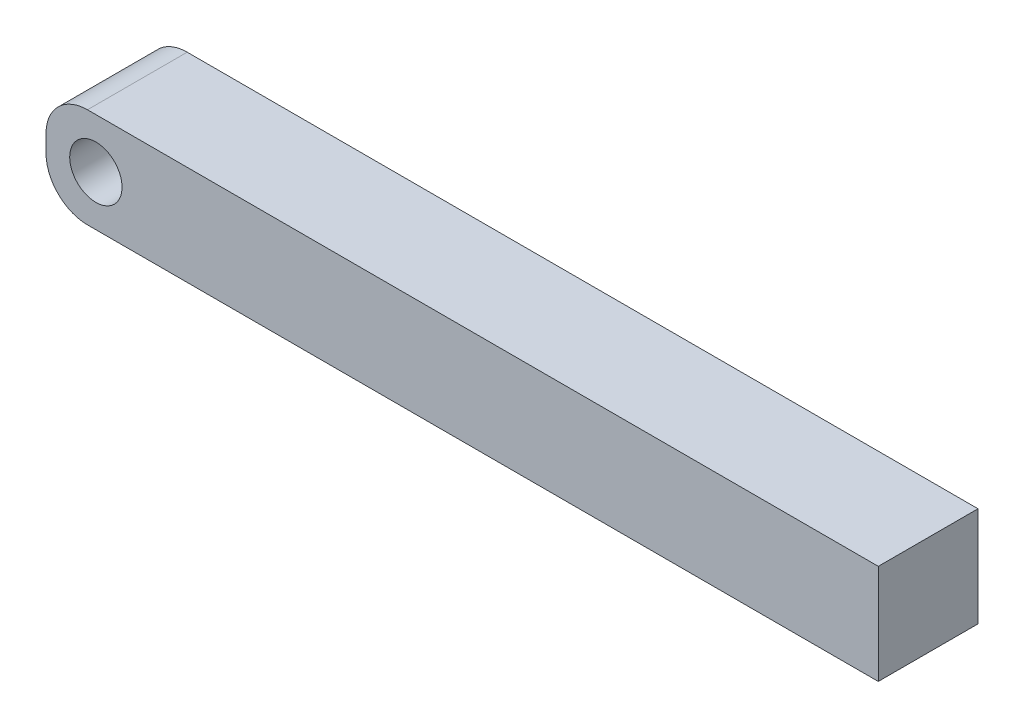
from build123d import *

# Parameters (mm, degrees)
SKETCH1_W           = 159.004
SKETCH1_H           = 19.05
SKETCH1_R           = 5
BOSS_EXTRUDE1_DEPTH = 9.525
FILLET1_R           = 7.9248


with BuildPart() as part:
    # Sketch1 → Boss-Extrude1 (new, symmetric)
    with BuildSketch(Plane.XY):
        with Locations((69.977, 0)):
            Rectangle(SKETCH1_W, SKETCH1_H)
        with Locations(Location((0, 0, 0), (0, 0, 180))):
            Circle(SKETCH1_R, mode=Mode.SUBTRACT)
    extrude(amount=BOSS_EXTRUDE1_DEPTH, both=True)

    # Fillet1
    fillet1_edges = [part.edges().sort_by_distance(p)[0] for p in [
        (-9.525, 9.525, 0),
        (-9.525, -9.525, 0),
    ]]
    fillet(fillet1_edges, radius=FILLET1_R)


solid = part.part
